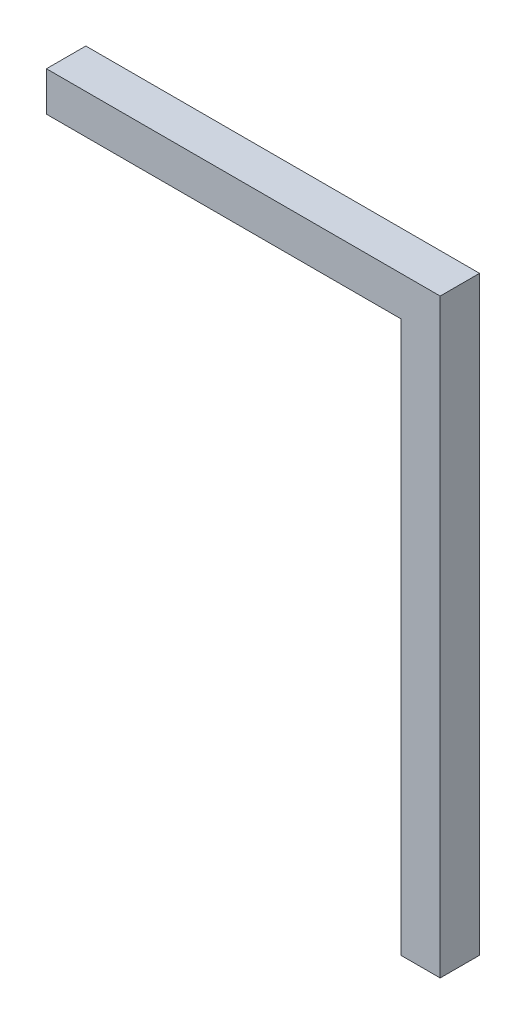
from build123d import *

# Parameters (mm, degrees)
EXTRU_MINCE1_DEPTH = 10


with BuildPart() as part:
    # Esquisse1 → Extru.-Mince1 (new body)
    with BuildSketch(Plane.XY):
        Polygon((-100, 0), (0, 0), (0, -150), (-10, -150), (-10, -10), (-100, -10), align=None)
    extrude(amount=EXTRU_MINCE1_DEPTH)


solid = part.part
